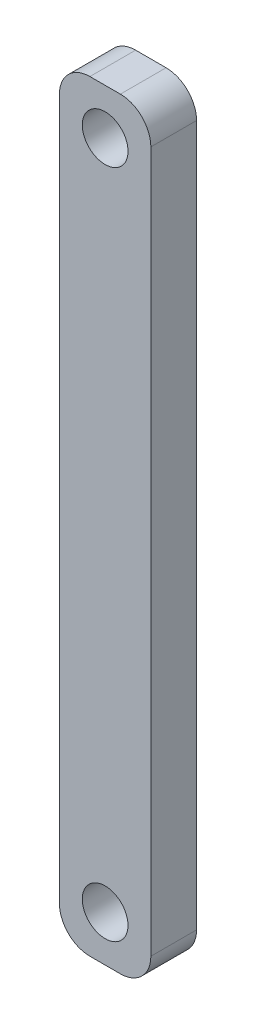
from build123d import *

# Parameters (mm, degrees)
SKETCH_1_W      = 6
SKETCH_1_H      = 50
SKETCH_1_R      = 1.5
EXTRUDE_1_DEPTH = 3
FILLET_1_R      = 2


with BuildPart() as part:
    # Sketch 1 → Extrude 1 (new body)
    with BuildSketch(Plane.XY):
        with Locations((3, -25)):
            Rectangle(SKETCH_1_W, SKETCH_1_H)
        with Locations((3, -3)):
            Circle(SKETCH_1_R, mode=Mode.SUBTRACT)
        with Locations((3, -47)):
            Circle(SKETCH_1_R, mode=Mode.SUBTRACT)
    extrude(amount=EXTRUDE_1_DEPTH)

    # Fillet 1
    fillet_1_edges = [part.edges().sort_by_distance(p)[0] for p in [
        (0, 0, 1.5),
        (6, 0, 1.5),
        (6, -50, 1.5),
        (0, -50, 1.5),
    ]]
    fillet(fillet_1_edges, radius=FILLET_1_R)


solid = part.part
